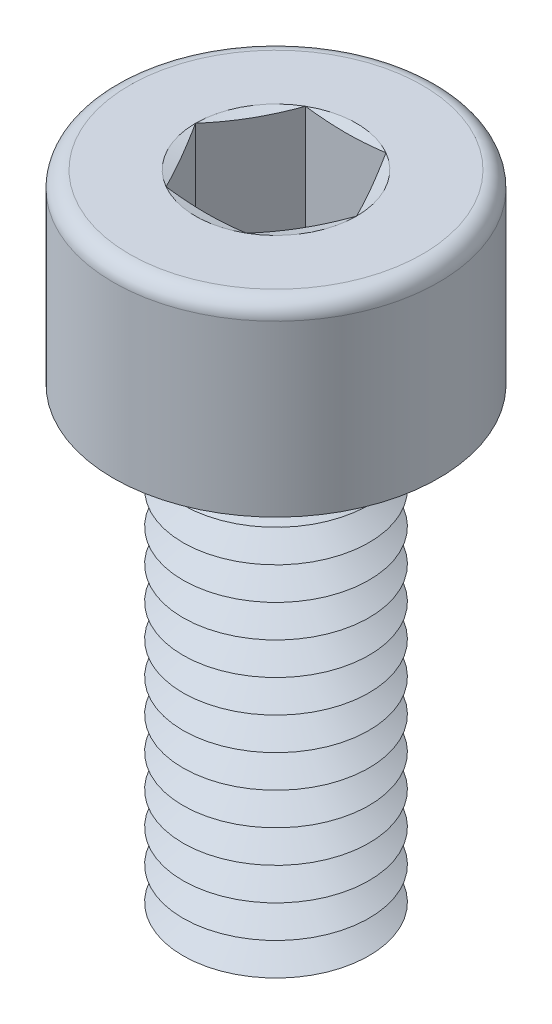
ISO-10303-21;
HEADER;
FILE_DESCRIPTION(('STEP AP214'),'2;1');
FILE_NAME('part.step','',(''),(''),'','','');
FILE_SCHEMA(('AUTOMOTIVE_DESIGN { 1 0 10303 214 1 1 1 1 }'));
ENDSEC;
DATA;
#1=APPLICATION_CONTEXT('core data for automotive mechanical design processes');
#2=APPLICATION_PROTOCOL_DEFINITION('international standard','automotive_design',2000,#1);
#3=PRODUCT_CONTEXT('',#1,'mechanical');
#4=PRODUCT('Part','Part','',(#3));
#5=PRODUCT_RELATED_PRODUCT_CATEGORY('part','',(#4));
#6=PRODUCT_DEFINITION_FORMATION('','',#4);
#7=PRODUCT_DEFINITION_CONTEXT('part definition',#1,'design');
#8=PRODUCT_DEFINITION('design','',#6,#7);
#9=PRODUCT_DEFINITION_SHAPE('','',#8);
#10=(LENGTH_UNIT() NAMED_UNIT(*) SI_UNIT(.MILLI.,.METRE.));
#11=(NAMED_UNIT(*) PLANE_ANGLE_UNIT() SI_UNIT($,.RADIAN.));
#12=(NAMED_UNIT(*) SI_UNIT($,.STERADIAN.) SOLID_ANGLE_UNIT());
#13=UNCERTAINTY_MEASURE_WITH_UNIT(LENGTH_MEASURE(1.E-05),#10,'distance_accuracy_value','');
#14=(GEOMETRIC_REPRESENTATION_CONTEXT(3) GLOBAL_UNCERTAINTY_ASSIGNED_CONTEXT((#13)) GLOBAL_UNIT_ASSIGNED_CONTEXT((#10,
#11,#12)) REPRESENTATION_CONTEXT('',''));
#15=CARTESIAN_POINT('',(0.,0.,0.));
#16=DIRECTION('',(0.,0.,1.));
#17=DIRECTION('',(1.,0.,0.));
#18=AXIS2_PLACEMENT_3D('',#15,#16,#17);
#19=CARTESIAN_POINT('',(0.,2.8,0.));
#20=DIRECTION('',(0.,1.,0.));
#21=DIRECTION('',(0.,0.,1.));
#22=AXIS2_PLACEMENT_3D('',#19,#20,#21);
#23=CONICAL_SURFACE('',#22,1.39378221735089,1.0471975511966);
#24=CARTESIAN_POINT('',(0.,3.15,0.));
#25=DIRECTION('',(0.,1.,0.));
#26=DIRECTION('',(0.,0.,1.));
#27=AXIS2_PLACEMENT_3D('',#24,#25,#26);
#28=CIRCLE('',#27,2.);
#29=CARTESIAN_POINT('',(0.,3.15,2.));
#30=VERTEX_POINT('',#29);
#31=EDGE_CURVE('E385',#30,#30,#28,.T.);
#32=ORIENTED_EDGE('',*,*,#31,.F.);
#33=EDGE_LOOP('',(#32));
#34=FACE_BOUND('',#33,.T.);
#35=CARTESIAN_POINT('',(0.,2.8,0.));
#36=DIRECTION('',(0.,1.,0.));
#37=DIRECTION('',(0.,0.,1.));
#38=AXIS2_PLACEMENT_3D('',#35,#36,#37);
#39=CIRCLE('',#38,1.39378221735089);
#40=CARTESIAN_POINT('',(0.,2.8,1.39378221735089));
#41=VERTEX_POINT('',#40);
#42=EDGE_CURVE('E388',#41,#41,#39,.T.);
#43=ORIENTED_EDGE('',*,*,#42,.T.);
#44=EDGE_LOOP('',(#43));
#45=FACE_BOUND('',#44,.T.);
#46=ADVANCED_FACE('F36',(#34,#45),#23,.T.);
#47=CARTESIAN_POINT('',(0.,2.45,0.));
#48=DIRECTION('',(0.,-1.,0.));
#49=DIRECTION('',(0.,0.,-1.));
#50=AXIS2_PLACEMENT_3D('',#47,#48,#49);
#51=CONICAL_SURFACE('',#50,2.,1.0471975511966);
#52=ORIENTED_EDGE('',*,*,#42,.F.);
#53=EDGE_LOOP('',(#52));
#54=FACE_BOUND('',#53,.T.);
#55=CARTESIAN_POINT('',(0.,2.45,0.));
#56=DIRECTION('',(0.,1.,0.));
#57=DIRECTION('',(0.,0.,1.));
#58=AXIS2_PLACEMENT_3D('',#55,#56,#57);
#59=CIRCLE('',#58,2.);
#60=CARTESIAN_POINT('',(0.,2.45,2.));
#61=VERTEX_POINT('',#60);
#62=EDGE_CURVE('E391',#61,#61,#59,.T.);
#63=ORIENTED_EDGE('',*,*,#62,.T.);
#64=EDGE_LOOP('',(#63));
#65=FACE_BOUND('',#64,.T.);
#66=ADVANCED_FACE('F236',(#54,#65),#51,.T.);
#67=CARTESIAN_POINT('',(0.,0.,0.));
#68=DIRECTION('',(0.,1.,0.));
#69=DIRECTION('',(0.,0.,1.));
#70=AXIS2_PLACEMENT_3D('',#67,#68,#69);
#71=PLANE('',#70);
#72=CARTESIAN_POINT('',(0.,0.,0.));
#73=DIRECTION('',(0.,1.,0.));
#74=DIRECTION('',(0.,0.,1.));
#75=AXIS2_PLACEMENT_3D('',#72,#73,#74);
#76=CIRCLE('',#75,1.39378221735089);
#77=CARTESIAN_POINT('',(0.,0.,1.39378221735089));
#78=VERTEX_POINT('',#77);
#79=EDGE_CURVE('E412',#78,#78,#76,.T.);
#80=ORIENTED_EDGE('',*,*,#79,.F.);
#81=EDGE_LOOP('',(#80));
#82=FACE_BOUND('',#81,.T.);
#83=ADVANCED_FACE('F233',(#82),#71,.F.);
#84=CARTESIAN_POINT('',(0.,0.,0.));
#85=DIRECTION('',(0.,1.,0.));
#86=DIRECTION('',(0.,0.,1.));
#87=AXIS2_PLACEMENT_3D('',#84,#85,#86);
#88=CONICAL_SURFACE('',#87,1.39378221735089,1.0471975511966);
#89=CARTESIAN_POINT('',(0.,0.35,0.));
#90=DIRECTION('',(0.,1.,0.));
#91=DIRECTION('',(0.,0.,1.));
#92=AXIS2_PLACEMENT_3D('',#89,#90,#91);
#93=CIRCLE('',#92,2.);
#94=CARTESIAN_POINT('',(0.,0.35,2.));
#95=VERTEX_POINT('',#94);
#96=EDGE_CURVE('E409',#95,#95,#93,.T.);
#97=ORIENTED_EDGE('',*,*,#96,.F.);
#98=EDGE_LOOP('',(#97));
#99=FACE_BOUND('',#98,.T.);
#100=ORIENTED_EDGE('',*,*,#79,.T.);
#101=EDGE_LOOP('',(#100));
#102=FACE_BOUND('',#101,.T.);
#103=ADVANCED_FACE('F235',(#99,#102),#88,.T.);
#104=CARTESIAN_POINT('',(0.,0.35,0.));
#105=DIRECTION('',(0.,-1.,0.));
#106=DIRECTION('',(0.,0.,-1.));
#107=AXIS2_PLACEMENT_3D('',#104,#105,#106);
#108=CONICAL_SURFACE('',#107,2.,1.0471975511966);
#109=CARTESIAN_POINT('',(0.,0.7,0.));
#110=DIRECTION('',(0.,1.,0.));
#111=DIRECTION('',(0.,0.,1.));
#112=AXIS2_PLACEMENT_3D('',#109,#110,#111);
#113=CIRCLE('',#112,1.39378221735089);
#114=CARTESIAN_POINT('',(0.,0.7,1.39378221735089));
#115=VERTEX_POINT('',#114);
#116=EDGE_CURVE('E406',#115,#115,#113,.T.);
#117=ORIENTED_EDGE('',*,*,#116,.F.);
#118=EDGE_LOOP('',(#117));
#119=FACE_BOUND('',#118,.T.);
#120=ORIENTED_EDGE('',*,*,#96,.T.);
#121=EDGE_LOOP('',(#120));
#122=FACE_BOUND('',#121,.T.);
#123=ADVANCED_FACE('F276',(#119,#122),#108,.T.);
#124=CARTESIAN_POINT('',(0.,0.7,0.));
#125=DIRECTION('',(0.,1.,0.));
#126=DIRECTION('',(0.,0.,1.));
#127=AXIS2_PLACEMENT_3D('',#124,#125,#126);
#128=CONICAL_SURFACE('',#127,1.39378221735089,1.0471975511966);
#129=CARTESIAN_POINT('',(0.,1.05,0.));
#130=DIRECTION('',(0.,1.,0.));
#131=DIRECTION('',(0.,0.,1.));
#132=AXIS2_PLACEMENT_3D('',#129,#130,#131);
#133=CIRCLE('',#132,2.);
#134=CARTESIAN_POINT('',(0.,1.05,2.));
#135=VERTEX_POINT('',#134);
#136=EDGE_CURVE('E403',#135,#135,#133,.T.);
#137=ORIENTED_EDGE('',*,*,#136,.F.);
#138=EDGE_LOOP('',(#137));
#139=FACE_BOUND('',#138,.T.);
#140=ORIENTED_EDGE('',*,*,#116,.T.);
#141=EDGE_LOOP('',(#140));
#142=FACE_BOUND('',#141,.T.);
#143=ADVANCED_FACE('F271',(#139,#142),#128,.T.);
#144=CARTESIAN_POINT('',(0.,1.05,0.));
#145=DIRECTION('',(0.,-1.,0.));
#146=DIRECTION('',(0.,0.,-1.));
#147=AXIS2_PLACEMENT_3D('',#144,#145,#146);
#148=CONICAL_SURFACE('',#147,2.,1.0471975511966);
#149=CARTESIAN_POINT('',(0.,1.4,0.));
#150=DIRECTION('',(0.,1.,0.));
#151=DIRECTION('',(0.,0.,1.));
#152=AXIS2_PLACEMENT_3D('',#149,#150,#151);
#153=CIRCLE('',#152,1.39378221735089);
#154=CARTESIAN_POINT('',(0.,1.4,1.39378221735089));
#155=VERTEX_POINT('',#154);
#156=EDGE_CURVE('E400',#155,#155,#153,.T.);
#157=ORIENTED_EDGE('',*,*,#156,.F.);
#158=EDGE_LOOP('',(#157));
#159=FACE_BOUND('',#158,.T.);
#160=ORIENTED_EDGE('',*,*,#136,.T.);
#161=EDGE_LOOP('',(#160));
#162=FACE_BOUND('',#161,.T.);
#163=ADVANCED_FACE('F268',(#159,#162),#148,.T.);
#164=CARTESIAN_POINT('',(0.,1.4,0.));
#165=DIRECTION('',(0.,1.,0.));
#166=DIRECTION('',(0.,0.,1.));
#167=AXIS2_PLACEMENT_3D('',#164,#165,#166);
#168=CONICAL_SURFACE('',#167,1.39378221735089,1.0471975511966);
#169=CARTESIAN_POINT('',(0.,1.75,0.));
#170=DIRECTION('',(0.,1.,0.));
#171=DIRECTION('',(0.,0.,1.));
#172=AXIS2_PLACEMENT_3D('',#169,#170,#171);
#173=CIRCLE('',#172,2.);
#174=CARTESIAN_POINT('',(0.,1.75,2.));
#175=VERTEX_POINT('',#174);
#176=EDGE_CURVE('E397',#175,#175,#173,.T.);
#177=ORIENTED_EDGE('',*,*,#176,.F.);
#178=EDGE_LOOP('',(#177));
#179=FACE_BOUND('',#178,.T.);
#180=ORIENTED_EDGE('',*,*,#156,.T.);
#181=EDGE_LOOP('',(#180));
#182=FACE_BOUND('',#181,.T.);
#183=ADVANCED_FACE('F262',(#179,#182),#168,.T.);
#184=CARTESIAN_POINT('',(0.,1.75,0.));
#185=DIRECTION('',(0.,-1.,0.));
#186=DIRECTION('',(0.,0.,-1.));
#187=AXIS2_PLACEMENT_3D('',#184,#185,#186);
#188=CONICAL_SURFACE('',#187,2.,1.0471975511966);
#189=CARTESIAN_POINT('',(0.,2.1,0.));
#190=DIRECTION('',(0.,1.,0.));
#191=DIRECTION('',(0.,0.,1.));
#192=AXIS2_PLACEMENT_3D('',#189,#190,#191);
#193=CIRCLE('',#192,1.39378221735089);
#194=CARTESIAN_POINT('',(0.,2.1,1.39378221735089));
#195=VERTEX_POINT('',#194);
#196=EDGE_CURVE('E394',#195,#195,#193,.T.);
#197=ORIENTED_EDGE('',*,*,#196,.F.);
#198=EDGE_LOOP('',(#197));
#199=FACE_BOUND('',#198,.T.);
#200=ORIENTED_EDGE('',*,*,#176,.T.);
#201=EDGE_LOOP('',(#200));
#202=FACE_BOUND('',#201,.T.);
#203=ADVANCED_FACE('F258',(#199,#202),#188,.T.);
#204=CARTESIAN_POINT('',(0.,2.1,0.));
#205=DIRECTION('',(0.,1.,0.));
#206=DIRECTION('',(0.,0.,1.));
#207=AXIS2_PLACEMENT_3D('',#204,#205,#206);
#208=CONICAL_SURFACE('',#207,1.39378221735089,1.0471975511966);
#209=ORIENTED_EDGE('',*,*,#62,.F.);
#210=EDGE_LOOP('',(#209));
#211=FACE_BOUND('',#210,.T.);
#212=ORIENTED_EDGE('',*,*,#196,.T.);
#213=EDGE_LOOP('',(#212));
#214=FACE_BOUND('',#213,.T.);
#215=ADVANCED_FACE('F261',(#211,#214),#208,.T.);
#216=CARTESIAN_POINT('',(0.,3.5,0.));
#217=DIRECTION('',(0.,1.,0.));
#218=DIRECTION('',(0.,0.,1.));
#219=AXIS2_PLACEMENT_3D('',#216,#217,#218);
#220=CONICAL_SURFACE('',#219,1.39378221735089,1.0471975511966);
#221=CARTESIAN_POINT('',(0.,3.85,0.));
#222=DIRECTION('',(0.,1.,0.));
#223=DIRECTION('',(0.,0.,1.));
#224=AXIS2_PLACEMENT_3D('',#221,#222,#223);
#225=CIRCLE('',#224,2.);
#226=CARTESIAN_POINT('',(0.,3.85,2.));
#227=VERTEX_POINT('',#226);
#228=EDGE_CURVE('E379',#227,#227,#225,.T.);
#229=ORIENTED_EDGE('',*,*,#228,.F.);
#230=EDGE_LOOP('',(#229));
#231=FACE_BOUND('',#230,.T.);
#232=CARTESIAN_POINT('',(0.,3.5,0.));
#233=DIRECTION('',(0.,1.,0.));
#234=DIRECTION('',(0.,0.,1.));
#235=AXIS2_PLACEMENT_3D('',#232,#233,#234);
#236=CIRCLE('',#235,1.39378221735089);
#237=CARTESIAN_POINT('',(0.,3.5,1.39378221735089));
#238=VERTEX_POINT('',#237);
#239=EDGE_CURVE('E382',#238,#238,#236,.T.);
#240=ORIENTED_EDGE('',*,*,#239,.T.);
#241=EDGE_LOOP('',(#240));
#242=FACE_BOUND('',#241,.T.);
#243=ADVANCED_FACE('F266',(#231,#242),#220,.T.);
#244=CARTESIAN_POINT('',(0.,3.15,0.));
#245=DIRECTION('',(0.,-1.,0.));
#246=DIRECTION('',(0.,0.,-1.));
#247=AXIS2_PLACEMENT_3D('',#244,#245,#246);
#248=CONICAL_SURFACE('',#247,2.,1.0471975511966);
#249=ORIENTED_EDGE('',*,*,#239,.F.);
#250=EDGE_LOOP('',(#249));
#251=FACE_BOUND('',#250,.T.);
#252=ORIENTED_EDGE('',*,*,#31,.T.);
#253=EDGE_LOOP('',(#252));
#254=FACE_BOUND('',#253,.T.);
#255=ADVANCED_FACE('F697',(#251,#254),#248,.T.);
#256=CARTESIAN_POINT('',(0.,4.2,0.));
#257=DIRECTION('',(0.,1.,0.));
#258=DIRECTION('',(0.,0.,1.));
#259=AXIS2_PLACEMENT_3D('',#256,#257,#258);
#260=CONICAL_SURFACE('',#259,1.39378221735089,1.0471975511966);
#261=CARTESIAN_POINT('',(0.,4.55,0.));
#262=DIRECTION('',(0.,1.,0.));
#263=DIRECTION('',(0.,0.,1.));
#264=AXIS2_PLACEMENT_3D('',#261,#262,#263);
#265=CIRCLE('',#264,2.);
#266=CARTESIAN_POINT('',(0.,4.55,2.));
#267=VERTEX_POINT('',#266);
#268=EDGE_CURVE('E373',#267,#267,#265,.T.);
#269=ORIENTED_EDGE('',*,*,#268,.F.);
#270=EDGE_LOOP('',(#269));
#271=FACE_BOUND('',#270,.T.);
#272=CARTESIAN_POINT('',(0.,4.2,0.));
#273=DIRECTION('',(0.,1.,0.));
#274=DIRECTION('',(0.,0.,1.));
#275=AXIS2_PLACEMENT_3D('',#272,#273,#274);
#276=CIRCLE('',#275,1.39378221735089);
#277=CARTESIAN_POINT('',(0.,4.2,1.39378221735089));
#278=VERTEX_POINT('',#277);
#279=EDGE_CURVE('E376',#278,#278,#276,.T.);
#280=ORIENTED_EDGE('',*,*,#279,.T.);
#281=EDGE_LOOP('',(#280));
#282=FACE_BOUND('',#281,.T.);
#283=ADVANCED_FACE('F687',(#271,#282),#260,.T.);
#284=CARTESIAN_POINT('',(0.,3.85,0.));
#285=DIRECTION('',(0.,-1.,0.));
#286=DIRECTION('',(0.,0.,-1.));
#287=AXIS2_PLACEMENT_3D('',#284,#285,#286);
#288=CONICAL_SURFACE('',#287,2.,1.0471975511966);
#289=ORIENTED_EDGE('',*,*,#279,.F.);
#290=EDGE_LOOP('',(#289));
#291=FACE_BOUND('',#290,.T.);
#292=ORIENTED_EDGE('',*,*,#228,.T.);
#293=EDGE_LOOP('',(#292));
#294=FACE_BOUND('',#293,.T.);
#295=ADVANCED_FACE('F677',(#291,#294),#288,.T.);
#296=CARTESIAN_POINT('',(0.,4.9,0.));
#297=DIRECTION('',(0.,1.,0.));
#298=DIRECTION('',(0.,0.,1.));
#299=AXIS2_PLACEMENT_3D('',#296,#297,#298);
#300=CONICAL_SURFACE('',#299,1.39378221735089,1.0471975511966);
#301=CARTESIAN_POINT('',(0.,5.25,0.));
#302=DIRECTION('',(0.,1.,0.));
#303=DIRECTION('',(0.,0.,1.));
#304=AXIS2_PLACEMENT_3D('',#301,#302,#303);
#305=CIRCLE('',#304,2.);
#306=CARTESIAN_POINT('',(0.,5.25,2.));
#307=VERTEX_POINT('',#306);
#308=EDGE_CURVE('E367',#307,#307,#305,.T.);
#309=ORIENTED_EDGE('',*,*,#308,.F.);
#310=EDGE_LOOP('',(#309));
#311=FACE_BOUND('',#310,.T.);
#312=CARTESIAN_POINT('',(0.,4.9,0.));
#313=DIRECTION('',(0.,1.,0.));
#314=DIRECTION('',(0.,0.,1.));
#315=AXIS2_PLACEMENT_3D('',#312,#313,#314);
#316=CIRCLE('',#315,1.39378221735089);
#317=CARTESIAN_POINT('',(0.,4.9,1.39378221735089));
#318=VERTEX_POINT('',#317);
#319=EDGE_CURVE('E370',#318,#318,#316,.T.);
#320=ORIENTED_EDGE('',*,*,#319,.T.);
#321=EDGE_LOOP('',(#320));
#322=FACE_BOUND('',#321,.T.);
#323=ADVANCED_FACE('F667',(#311,#322),#300,.T.);
#324=CARTESIAN_POINT('',(0.,4.55,0.));
#325=DIRECTION('',(0.,-1.,0.));
#326=DIRECTION('',(0.,0.,-1.));
#327=AXIS2_PLACEMENT_3D('',#324,#325,#326);
#328=CONICAL_SURFACE('',#327,2.,1.0471975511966);
#329=ORIENTED_EDGE('',*,*,#319,.F.);
#330=EDGE_LOOP('',(#329));
#331=FACE_BOUND('',#330,.T.);
#332=ORIENTED_EDGE('',*,*,#268,.T.);
#333=EDGE_LOOP('',(#332));
#334=FACE_BOUND('',#333,.T.);
#335=ADVANCED_FACE('F657',(#331,#334),#328,.T.);
#336=CARTESIAN_POINT('',(0.,5.6,0.));
#337=DIRECTION('',(0.,1.,0.));
#338=DIRECTION('',(0.,0.,1.));
#339=AXIS2_PLACEMENT_3D('',#336,#337,#338);
#340=CONICAL_SURFACE('',#339,1.39378221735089,1.0471975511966);
#341=CARTESIAN_POINT('',(0.,5.95,0.));
#342=DIRECTION('',(0.,1.,0.));
#343=DIRECTION('',(0.,0.,1.));
#344=AXIS2_PLACEMENT_3D('',#341,#342,#343);
#345=CIRCLE('',#344,2.);
#346=CARTESIAN_POINT('',(0.,5.95,2.));
#347=VERTEX_POINT('',#346);
#348=EDGE_CURVE('E361',#347,#347,#345,.T.);
#349=ORIENTED_EDGE('',*,*,#348,.F.);
#350=EDGE_LOOP('',(#349));
#351=FACE_BOUND('',#350,.T.);
#352=CARTESIAN_POINT('',(0.,5.6,0.));
#353=DIRECTION('',(0.,1.,0.));
#354=DIRECTION('',(0.,0.,1.));
#355=AXIS2_PLACEMENT_3D('',#352,#353,#354);
#356=CIRCLE('',#355,1.39378221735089);
#357=CARTESIAN_POINT('',(0.,5.6,1.39378221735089));
#358=VERTEX_POINT('',#357);
#359=EDGE_CURVE('E364',#358,#358,#356,.T.);
#360=ORIENTED_EDGE('',*,*,#359,.T.);
#361=EDGE_LOOP('',(#360));
#362=FACE_BOUND('',#361,.T.);
#363=ADVANCED_FACE('F647',(#351,#362),#340,.T.);
#364=CARTESIAN_POINT('',(0.,5.25,0.));
#365=DIRECTION('',(0.,-1.,0.));
#366=DIRECTION('',(0.,0.,-1.));
#367=AXIS2_PLACEMENT_3D('',#364,#365,#366);
#368=CONICAL_SURFACE('',#367,2.,1.0471975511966);
#369=ORIENTED_EDGE('',*,*,#359,.F.);
#370=EDGE_LOOP('',(#369));
#371=FACE_BOUND('',#370,.T.);
#372=ORIENTED_EDGE('',*,*,#308,.T.);
#373=EDGE_LOOP('',(#372));
#374=FACE_BOUND('',#373,.T.);
#375=ADVANCED_FACE('F637',(#371,#374),#368,.T.);
#376=CARTESIAN_POINT('',(0.,6.3,0.));
#377=DIRECTION('',(0.,1.,0.));
#378=DIRECTION('',(0.,0.,1.));
#379=AXIS2_PLACEMENT_3D('',#376,#377,#378);
#380=CONICAL_SURFACE('',#379,1.39378221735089,1.0471975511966);
#381=CARTESIAN_POINT('',(0.,6.65,0.));
#382=DIRECTION('',(0.,1.,0.));
#383=DIRECTION('',(0.,0.,1.));
#384=AXIS2_PLACEMENT_3D('',#381,#382,#383);
#385=CIRCLE('',#384,2.);
#386=CARTESIAN_POINT('',(0.,6.65,2.));
#387=VERTEX_POINT('',#386);
#388=EDGE_CURVE('E355',#387,#387,#385,.T.);
#389=ORIENTED_EDGE('',*,*,#388,.F.);
#390=EDGE_LOOP('',(#389));
#391=FACE_BOUND('',#390,.T.);
#392=CARTESIAN_POINT('',(0.,6.3,0.));
#393=DIRECTION('',(0.,1.,0.));
#394=DIRECTION('',(0.,0.,1.));
#395=AXIS2_PLACEMENT_3D('',#392,#393,#394);
#396=CIRCLE('',#395,1.39378221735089);
#397=CARTESIAN_POINT('',(0.,6.3,1.39378221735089));
#398=VERTEX_POINT('',#397);
#399=EDGE_CURVE('E358',#398,#398,#396,.T.);
#400=ORIENTED_EDGE('',*,*,#399,.T.);
#401=EDGE_LOOP('',(#400));
#402=FACE_BOUND('',#401,.T.);
#403=ADVANCED_FACE('F627',(#391,#402),#380,.T.);
#404=CARTESIAN_POINT('',(0.,5.95,0.));
#405=DIRECTION('',(0.,-1.,0.));
#406=DIRECTION('',(0.,0.,-1.));
#407=AXIS2_PLACEMENT_3D('',#404,#405,#406);
#408=CONICAL_SURFACE('',#407,2.,1.0471975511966);
#409=ORIENTED_EDGE('',*,*,#399,.F.);
#410=EDGE_LOOP('',(#409));
#411=FACE_BOUND('',#410,.T.);
#412=ORIENTED_EDGE('',*,*,#348,.T.);
#413=EDGE_LOOP('',(#412));
#414=FACE_BOUND('',#413,.T.);
#415=ADVANCED_FACE('F617',(#411,#414),#408,.T.);
#416=CARTESIAN_POINT('',(0.,7.,0.));
#417=DIRECTION('',(0.,1.,0.));
#418=DIRECTION('',(0.,0.,1.));
#419=AXIS2_PLACEMENT_3D('',#416,#417,#418);
#420=CONICAL_SURFACE('',#419,1.39378221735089,1.0471975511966);
#421=CARTESIAN_POINT('',(0.,7.35,0.));
#422=DIRECTION('',(0.,1.,0.));
#423=DIRECTION('',(0.,0.,1.));
#424=AXIS2_PLACEMENT_3D('',#421,#422,#423);
#425=CIRCLE('',#424,2.);
#426=CARTESIAN_POINT('',(0.,7.35,2.));
#427=VERTEX_POINT('',#426);
#428=EDGE_CURVE('E349',#427,#427,#425,.T.);
#429=ORIENTED_EDGE('',*,*,#428,.F.);
#430=EDGE_LOOP('',(#429));
#431=FACE_BOUND('',#430,.T.);
#432=CARTESIAN_POINT('',(0.,7.,0.));
#433=DIRECTION('',(0.,1.,0.));
#434=DIRECTION('',(0.,0.,1.));
#435=AXIS2_PLACEMENT_3D('',#432,#433,#434);
#436=CIRCLE('',#435,1.39378221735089);
#437=CARTESIAN_POINT('',(0.,7.,1.39378221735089));
#438=VERTEX_POINT('',#437);
#439=EDGE_CURVE('E352',#438,#438,#436,.T.);
#440=ORIENTED_EDGE('',*,*,#439,.T.);
#441=EDGE_LOOP('',(#440));
#442=FACE_BOUND('',#441,.T.);
#443=ADVANCED_FACE('F607',(#431,#442),#420,.T.);
#444=CARTESIAN_POINT('',(0.,6.65,0.));
#445=DIRECTION('',(0.,-1.,0.));
#446=DIRECTION('',(0.,0.,-1.));
#447=AXIS2_PLACEMENT_3D('',#444,#445,#446);
#448=CONICAL_SURFACE('',#447,2.,1.0471975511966);
#449=ORIENTED_EDGE('',*,*,#439,.F.);
#450=EDGE_LOOP('',(#449));
#451=FACE_BOUND('',#450,.T.);
#452=ORIENTED_EDGE('',*,*,#388,.T.);
#453=EDGE_LOOP('',(#452));
#454=FACE_BOUND('',#453,.T.);
#455=ADVANCED_FACE('F597',(#451,#454),#448,.T.);
#456=CARTESIAN_POINT('',(0.,7.7,0.));
#457=DIRECTION('',(0.,1.,0.));
#458=DIRECTION('',(0.,0.,1.));
#459=AXIS2_PLACEMENT_3D('',#456,#457,#458);
#460=CONICAL_SURFACE('',#459,1.39378221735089,1.0471975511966);
#461=CARTESIAN_POINT('',(0.,8.05,0.));
#462=DIRECTION('',(0.,1.,0.));
#463=DIRECTION('',(0.,0.,1.));
#464=AXIS2_PLACEMENT_3D('',#461,#462,#463);
#465=CIRCLE('',#464,2.);
#466=CARTESIAN_POINT('',(0.,8.05,2.));
#467=VERTEX_POINT('',#466);
#468=EDGE_CURVE('E343',#467,#467,#465,.T.);
#469=ORIENTED_EDGE('',*,*,#468,.F.);
#470=EDGE_LOOP('',(#469));
#471=FACE_BOUND('',#470,.T.);
#472=CARTESIAN_POINT('',(0.,7.7,0.));
#473=DIRECTION('',(0.,1.,0.));
#474=DIRECTION('',(0.,0.,1.));
#475=AXIS2_PLACEMENT_3D('',#472,#473,#474);
#476=CIRCLE('',#475,1.39378221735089);
#477=CARTESIAN_POINT('',(0.,7.7,1.39378221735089));
#478=VERTEX_POINT('',#477);
#479=EDGE_CURVE('E346',#478,#478,#476,.T.);
#480=ORIENTED_EDGE('',*,*,#479,.T.);
#481=EDGE_LOOP('',(#480));
#482=FACE_BOUND('',#481,.T.);
#483=ADVANCED_FACE('F587',(#471,#482),#460,.T.);
#484=CARTESIAN_POINT('',(0.,7.35,0.));
#485=DIRECTION('',(0.,-1.,0.));
#486=DIRECTION('',(0.,0.,-1.));
#487=AXIS2_PLACEMENT_3D('',#484,#485,#486);
#488=CONICAL_SURFACE('',#487,2.,1.0471975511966);
#489=ORIENTED_EDGE('',*,*,#479,.F.);
#490=EDGE_LOOP('',(#489));
#491=FACE_BOUND('',#490,.T.);
#492=ORIENTED_EDGE('',*,*,#428,.T.);
#493=EDGE_LOOP('',(#492));
#494=FACE_BOUND('',#493,.T.);
#495=ADVANCED_FACE('F577',(#491,#494),#488,.T.);
#496=CARTESIAN_POINT('',(0.,8.4,0.));
#497=DIRECTION('',(0.,1.,0.));
#498=DIRECTION('',(0.,0.,1.));
#499=AXIS2_PLACEMENT_3D('',#496,#497,#498);
#500=CONICAL_SURFACE('',#499,1.39378221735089,1.0471975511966);
#501=CARTESIAN_POINT('',(0.,8.75,0.));
#502=DIRECTION('',(0.,1.,0.));
#503=DIRECTION('',(0.,0.,1.));
#504=AXIS2_PLACEMENT_3D('',#501,#502,#503);
#505=CIRCLE('',#504,2.);
#506=CARTESIAN_POINT('',(0.,8.75,2.));
#507=VERTEX_POINT('',#506);
#508=EDGE_CURVE('E332',#507,#507,#505,.T.);
#509=ORIENTED_EDGE('',*,*,#508,.F.);
#510=EDGE_LOOP('',(#509));
#511=FACE_BOUND('',#510,.T.);
#512=CARTESIAN_POINT('',(0.,8.4,0.));
#513=DIRECTION('',(0.,1.,0.));
#514=DIRECTION('',(0.,0.,1.));
#515=AXIS2_PLACEMENT_3D('',#512,#513,#514);
#516=CIRCLE('',#515,1.39378221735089);
#517=CARTESIAN_POINT('',(0.,8.4,1.39378221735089));
#518=VERTEX_POINT('',#517);
#519=EDGE_CURVE('E340',#518,#518,#516,.T.);
#520=ORIENTED_EDGE('',*,*,#519,.T.);
#521=EDGE_LOOP('',(#520));
#522=FACE_BOUND('',#521,.T.);
#523=ADVANCED_FACE('F567',(#511,#522),#500,.T.);
#524=CARTESIAN_POINT('',(0.,8.05,0.));
#525=DIRECTION('',(0.,-1.,0.));
#526=DIRECTION('',(0.,0.,-1.));
#527=AXIS2_PLACEMENT_3D('',#524,#525,#526);
#528=CONICAL_SURFACE('',#527,2.,1.0471975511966);
#529=ORIENTED_EDGE('',*,*,#519,.F.);
#530=EDGE_LOOP('',(#529));
#531=FACE_BOUND('',#530,.T.);
#532=ORIENTED_EDGE('',*,*,#468,.T.);
#533=EDGE_LOOP('',(#532));
#534=FACE_BOUND('',#533,.T.);
#535=ADVANCED_FACE('F558',(#531,#534),#528,.T.);
#536=CARTESIAN_POINT('',(0.,9.1,0.));
#537=DIRECTION('',(0.,1.,0.));
#538=DIRECTION('',(0.,0.,1.));
#539=AXIS2_PLACEMENT_3D('',#536,#537,#538);
#540=CONICAL_SURFACE('',#539,1.39378221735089,1.0471975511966);
#541=CARTESIAN_POINT('',(0.,9.45,0.));
#542=DIRECTION('',(0.,1.,0.));
#543=DIRECTION('',(0.,0.,1.));
#544=AXIS2_PLACEMENT_3D('',#541,#542,#543);
#545=CIRCLE('',#544,2.);
#546=CARTESIAN_POINT('',(0.,9.45,2.));
#547=VERTEX_POINT('',#546);
#548=EDGE_CURVE('E336',#547,#547,#545,.T.);
#549=ORIENTED_EDGE('',*,*,#548,.F.);
#550=EDGE_LOOP('',(#549));
#551=FACE_BOUND('',#550,.T.);
#552=CARTESIAN_POINT('',(0.,9.1,0.));
#553=DIRECTION('',(0.,1.,0.));
#554=DIRECTION('',(0.,0.,1.));
#555=AXIS2_PLACEMENT_3D('',#552,#553,#554);
#556=CIRCLE('',#555,1.39378221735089);
#557=CARTESIAN_POINT('',(0.,9.1,1.39378221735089));
#558=VERTEX_POINT('',#557);
#559=EDGE_CURVE('E330',#558,#558,#556,.T.);
#560=ORIENTED_EDGE('',*,*,#559,.T.);
#561=EDGE_LOOP('',(#560));
#562=FACE_BOUND('',#561,.T.);
#563=ADVANCED_FACE('F549',(#551,#562),#540,.T.);
#564=CARTESIAN_POINT('',(0.,8.75,0.));
#565=DIRECTION('',(0.,-1.,0.));
#566=DIRECTION('',(0.,0.,-1.));
#567=AXIS2_PLACEMENT_3D('',#564,#565,#566);
#568=CONICAL_SURFACE('',#567,2.,1.0471975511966);
#569=ORIENTED_EDGE('',*,*,#559,.F.);
#570=EDGE_LOOP('',(#569));
#571=FACE_BOUND('',#570,.T.);
#572=ORIENTED_EDGE('',*,*,#508,.T.);
#573=EDGE_LOOP('',(#572));
#574=FACE_BOUND('',#573,.T.);
#575=ADVANCED_FACE('F181',(#571,#574),#568,.T.);
#576=CARTESIAN_POINT('',(0.,14.,0.));
#577=DIRECTION('',(0.,1.,0.));
#578=DIRECTION('',(0.,0.,1.));
#579=AXIS2_PLACEMENT_3D('',#576,#577,#578);
#580=PLANE('',#579);
#581=CARTESIAN_POINT('',(0.,14.,0.));
#582=DIRECTION('',(0.,1.,0.));
#583=DIRECTION('',(0.,0.,1.));
#584=AXIS2_PLACEMENT_3D('',#581,#582,#583);
#585=CIRCLE('',#584,1.73205080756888);
#586=CARTESIAN_POINT('',(0.866025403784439,14.,1.5));
#587=VERTEX_POINT('',#586);
#588=CARTESIAN_POINT('',(1.73205080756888,14.,0.));
#589=VERTEX_POINT('',#588);
#590=EDGE_CURVE('E115',#587,#589,#585,.T.);
#591=ORIENTED_EDGE('',*,*,#590,.F.);
#592=CARTESIAN_POINT('',(0.,14.,0.));
#593=DIRECTION('',(0.,1.,0.));
#594=DIRECTION('',(0.,0.,1.));
#595=AXIS2_PLACEMENT_3D('',#592,#593,#594);
#596=CIRCLE('',#595,1.73205080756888);
#597=CARTESIAN_POINT('',(-0.866025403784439,14.,1.5));
#598=VERTEX_POINT('',#597);
#599=EDGE_CURVE('E40',#598,#587,#596,.T.);
#600=ORIENTED_EDGE('',*,*,#599,.F.);
#601=CARTESIAN_POINT('',(-1.73205080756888,14.,0.));
#602=VERTEX_POINT('',#601);
#603=EDGE_CURVE('E130',#602,#598,#596,.T.);
#604=ORIENTED_EDGE('',*,*,#603,.F.);
#605=CARTESIAN_POINT('',(-0.866025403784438,14.,-1.5));
#606=VERTEX_POINT('',#605);
#607=EDGE_CURVE('E893',#606,#602,#596,.T.);
#608=ORIENTED_EDGE('',*,*,#607,.F.);
#609=CARTESIAN_POINT('',(0.866025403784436,14.,-1.5));
#610=VERTEX_POINT('',#609);
#611=EDGE_CURVE('E45',#610,#606,#596,.T.);
#612=ORIENTED_EDGE('',*,*,#611,.F.);
#613=EDGE_CURVE('E11',#589,#610,#596,.T.);
#614=ORIENTED_EDGE('',*,*,#613,.F.);
#615=EDGE_LOOP('',(#591,#600,#604,#608,#612,#614));
#616=FACE_BOUND('',#615,.T.);
#617=CARTESIAN_POINT('',(0.,14.,0.));
#618=DIRECTION('',(0.,1.,0.));
#619=DIRECTION('',(0.,0.,1.));
#620=AXIS2_PLACEMENT_3D('',#617,#618,#619);
#621=CIRCLE('',#620,3.15);
#622=CARTESIAN_POINT('',(0.,14.,3.15));
#623=VERTEX_POINT('',#622);
#624=EDGE_CURVE('E444',#623,#623,#621,.T.);
#625=ORIENTED_EDGE('',*,*,#624,.T.);
#626=EDGE_LOOP('',(#625));
#627=FACE_BOUND('',#626,.T.);
#628=ADVANCED_FACE('F132',(#616,#627),#580,.T.);
#629=CARTESIAN_POINT('',(0.,13.65,0.));
#630=DIRECTION('',(0.,1.,0.));
#631=DIRECTION('',(0.,0.,1.));
#632=AXIS2_PLACEMENT_3D('',#629,#630,#631);
#633=TOROIDAL_SURFACE('',#632,3.15,0.35);
#634=CARTESIAN_POINT('',(0.,13.65,0.));
#635=DIRECTION('',(0.,1.,0.));
#636=DIRECTION('',(0.,0.,1.));
#637=AXIS2_PLACEMENT_3D('',#634,#635,#636);
#638=CIRCLE('',#637,3.5);
#639=CARTESIAN_POINT('',(0.,13.65,3.5));
#640=VERTEX_POINT('',#639);
#641=EDGE_CURVE('E447',#640,#640,#638,.F.);
#642=ORIENTED_EDGE('',*,*,#641,.F.);
#643=EDGE_LOOP('',(#642));
#644=FACE_BOUND('',#643,.T.);
#645=ORIENTED_EDGE('',*,*,#624,.F.);
#646=EDGE_LOOP('',(#645));
#647=FACE_BOUND('',#646,.T.);
#648=ADVANCED_FACE('F38',(#644,#647),#633,.T.);
#649=CARTESIAN_POINT('',(0.,14.,0.));
#650=DIRECTION('',(0.,-1.,0.));
#651=DIRECTION('',(0.,0.,-1.));
#652=AXIS2_PLACEMENT_3D('',#649,#650,#651);
#653=CYLINDRICAL_SURFACE('',#652,3.5);
#654=ORIENTED_EDGE('',*,*,#641,.T.);
#655=EDGE_LOOP('',(#654));
#656=FACE_BOUND('',#655,.T.);
#657=CARTESIAN_POINT('',(0.,10.,0.));
#658=DIRECTION('',(0.,1.,0.));
#659=DIRECTION('',(0.,0.,1.));
#660=AXIS2_PLACEMENT_3D('',#657,#658,#659);
#661=CIRCLE('',#660,3.5);
#662=CARTESIAN_POINT('',(0.,10.,3.5));
#663=VERTEX_POINT('',#662);
#664=EDGE_CURVE('E435',#663,#663,#661,.T.);
#665=ORIENTED_EDGE('',*,*,#664,.T.);
#666=EDGE_LOOP('',(#665));
#667=FACE_BOUND('',#666,.T.);
#668=ADVANCED_FACE('F228',(#656,#667),#653,.T.);
#669=CARTESIAN_POINT('',(0.,10.,0.));
#670=DIRECTION('',(0.,1.,0.));
#671=DIRECTION('',(0.,0.,1.));
#672=AXIS2_PLACEMENT_3D('',#669,#670,#671);
#673=PLANE('',#672);
#674=ORIENTED_EDGE('',*,*,#664,.F.);
#675=EDGE_LOOP('',(#674));
#676=FACE_BOUND('',#675,.T.);
#677=CARTESIAN_POINT('',(0.,10.,0.));
#678=DIRECTION('',(0.,1.,0.));
#679=DIRECTION('',(0.,0.,1.));
#680=AXIS2_PLACEMENT_3D('',#677,#678,#679);
#681=CIRCLE('',#680,2.);
#682=CARTESIAN_POINT('',(0.,10.,2.));
#683=VERTEX_POINT('',#682);
#684=EDGE_CURVE('E441',#683,#683,#681,.T.);
#685=ORIENTED_EDGE('',*,*,#684,.T.);
#686=EDGE_LOOP('',(#685));
#687=FACE_BOUND('',#686,.T.);
#688=ADVANCED_FACE('F224',(#676,#687),#673,.F.);
#689=CARTESIAN_POINT('',(0.,10.,0.));
#690=DIRECTION('',(0.,-1.,0.));
#691=DIRECTION('',(0.,0.,-1.));
#692=AXIS2_PLACEMENT_3D('',#689,#690,#691);
#693=CYLINDRICAL_SURFACE('',#692,2.);
#694=ORIENTED_EDGE('',*,*,#548,.T.);
#695=EDGE_LOOP('',(#694));
#696=FACE_BOUND('',#695,.T.);
#697=ORIENTED_EDGE('',*,*,#684,.F.);
#698=EDGE_LOOP('',(#697));
#699=FACE_BOUND('',#698,.T.);
#700=ADVANCED_FACE('F227',(#696,#699),#693,.T.);
#701=CARTESIAN_POINT('',(0.,14.,0.));
#702=DIRECTION('',(0.,1.,0.));
#703=DIRECTION('',(0.,0.,1.));
#704=AXIS2_PLACEMENT_3D('',#701,#702,#703);
#705=CONICAL_SURFACE('',#704,1.73205080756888,1.30899693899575);
#706=ORIENTED_EDGE('',*,*,#599,.T.);
#707=CARTESIAN_POINT('',(-2.26080568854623,14.2628876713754,1.5));
#708=CARTESIAN_POINT('',(-2.19307335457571,14.247767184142,1.5));
#709=CARTESIAN_POINT('',(-2.12529797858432,14.2328393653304,1.5));
#710=CARTESIAN_POINT('',(-1.98963961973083,14.203466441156,1.5));
#711=CARTESIAN_POINT('',(-1.92175663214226,14.1890213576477,1.5));
#712=CARTESIAN_POINT('',(-1.71778516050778,14.146529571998,1.5));
#713=CARTESIAN_POINT('',(-1.58151166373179,14.1193574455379,1.5));
#714=CARTESIAN_POINT('',(-1.30947840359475,14.0687885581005,1.5));
#715=CARTESIAN_POINT('',(-1.17372447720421,14.0453610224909,1.5));
#716=CARTESIAN_POINT('',(-0.901404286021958,14.0038503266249,1.5));
#717=CARTESIAN_POINT('',(-0.764838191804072,13.9857660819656,1.5));
#718=CARTESIAN_POINT('',(-0.48929318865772,13.9572920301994,1.5));
#719=CARTESIAN_POINT('',(-0.350304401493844,13.9469908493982,1.5));
#720=CARTESIAN_POINT('',(-0.141571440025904,13.9391816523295,1.5));
#721=CARTESIAN_POINT('',(-0.0719628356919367,13.937851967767,1.5));
#722=CARTESIAN_POINT('',(0.0672555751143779,13.9377933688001,1.5));
#723=CARTESIAN_POINT('',(0.136865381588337,13.9390644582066,1.5));
#724=CARTESIAN_POINT('',(0.346114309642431,13.9467225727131,1.5));
#725=CARTESIAN_POINT('',(0.485619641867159,13.9569747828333,1.5));
#726=CARTESIAN_POINT('',(0.763829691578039,13.9856001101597,1.5));
#727=CARTESIAN_POINT('',(0.902533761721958,14.0039790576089,1.5));
#728=CARTESIAN_POINT('',(1.18270277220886,14.0467752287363,1.5));
#729=CARTESIAN_POINT('',(1.32414472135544,14.0713381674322,1.5));
#730=CARTESIAN_POINT('',(1.60634089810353,14.1241771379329,1.5));
#731=CARTESIAN_POINT('',(1.7470950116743,14.1524537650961,1.5));
#732=CARTESIAN_POINT('',(2.02813528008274,14.2114128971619,1.5));
#733=CARTESIAN_POINT('',(2.16842128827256,14.2420960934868,1.5));
#734=CARTESIAN_POINT('',(2.4486355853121,14.3050575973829,1.5));
#735=CARTESIAN_POINT('',(2.58856386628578,14.3373359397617,1.5));
#736=CARTESIAN_POINT('',(2.86645602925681,14.4025869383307,1.5));
#737=CARTESIAN_POINT('',(3.00442304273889,14.435546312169,1.5));
#738=CARTESIAN_POINT('',(3.28017563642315,14.5022271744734,1.5));
#739=CARTESIAN_POINT('',(3.41796121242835,14.5359486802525,1.5));
#740=CARTESIAN_POINT('',(3.69320305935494,14.6038996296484,1.5));
#741=CARTESIAN_POINT('',(3.83065952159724,14.6381282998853,1.5));
#742=CARTESIAN_POINT('',(4.10546119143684,14.7070087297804,1.5));
#743=CARTESIAN_POINT('',(4.24280640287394,14.7416604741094,1.5));
#744=CARTESIAN_POINT('',(4.38011382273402,14.7764596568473,1.5));
#745=B_SPLINE_CURVE_WITH_KNOTS('',3,(#707,#708,#709,#710,#711,#712,#713,#714,#715,#716,#717,
#718,#719,#720,#721,#722,#723,#724,#725,#726,#727,#728,#729,#730,#731,#732,#733,#734,#735,#736,
#737,#738,#739,#740,#741,#742,#743,#744),.UNSPECIFIED.,.F.,.F.,(4,2,2,2,2,2,2,2,2,2,2,2,2,2,2,2,
2,2,4),(0.,0.208198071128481,0.416405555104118,0.833243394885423,1.24645656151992,
1.65958581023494,2.07735129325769,2.28617008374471,2.49498918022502,2.91428402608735,
3.33388016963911,3.76448033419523,4.19514961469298,4.62594308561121,5.05674596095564,
5.48229088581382,5.90784548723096,6.33280701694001,6.75775319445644),.UNSPECIFIED.);
#746=EDGE_CURVE('E120',#598,#587,#745,.T.);
#747=ORIENTED_EDGE('',*,*,#746,.F.);
#748=EDGE_LOOP('',(#706,#747));
#749=FACE_BOUND('',#748,.T.);
#750=ADVANCED_FACE('F125',(#749),#705,.F.);
#751=ORIENTED_EDGE('',*,*,#603,.T.);
#752=CARTESIAN_POINT('',(-1.73216627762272,14.0000309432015,-0.000200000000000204));
#753=CARTESIAN_POINT('',(-1.69619286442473,13.9903863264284,0.0621077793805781));
#754=CARTESIAN_POINT('',(-1.66015421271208,13.9816304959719,0.124528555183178));
#755=CARTESIAN_POINT('',(-1.58794959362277,13.9662471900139,0.249590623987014));
#756=CARTESIAN_POINT('',(-1.55178358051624,13.9596205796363,0.312231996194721));
#757=CARTESIAN_POINT('',(-1.47954358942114,13.948882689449,0.437355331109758));
#758=CARTESIAN_POINT('',(-1.44347010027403,13.9447586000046,0.499836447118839));
#759=CARTESIAN_POINT('',(-1.37127710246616,13.9392286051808,0.624878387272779));
#760=CARTESIAN_POINT('',(-1.33515760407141,13.9378221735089,0.687439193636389));
#761=CARTESIAN_POINT('',(-1.26291860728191,13.9378221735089,0.81256080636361));
#762=CARTESIAN_POINT('',(-1.22679910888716,13.9392286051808,0.87512161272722));
#763=CARTESIAN_POINT('',(-1.15460611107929,13.9447586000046,1.00016355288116));
#764=CARTESIAN_POINT('',(-1.11853262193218,13.948882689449,1.06264466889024));
#765=CARTESIAN_POINT('',(-1.04629263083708,13.9596205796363,1.18776800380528));
#766=CARTESIAN_POINT('',(-1.01012661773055,13.9662471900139,1.25040937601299));
#767=CARTESIAN_POINT('',(-0.937921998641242,13.9816304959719,1.37547144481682));
#768=CARTESIAN_POINT('',(-0.901883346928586,13.9903863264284,1.43789222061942));
#769=CARTESIAN_POINT('',(-0.865909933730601,14.0000309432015,1.5002));
#770=B_SPLINE_CURVE_WITH_KNOTS('',3,(#752,#753,#754,#755,#756,#757,#758,#759,#760,#761,#762,
#763,#764,#765,#766,#767,#768,#769),.UNSPECIFIED.,.F.,.F.,(4,2,2,2,2,2,2,2,4),(0.,
0.217782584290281,0.435653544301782,0.652399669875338,0.869103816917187,1.08580796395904,
1.30255408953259,1.52042504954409,1.73820763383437),.UNSPECIFIED.);
#771=EDGE_CURVE('E152',#602,#598,#770,.T.);
#772=ORIENTED_EDGE('',*,*,#771,.F.);
#773=EDGE_LOOP('',(#751,#772));
#774=FACE_BOUND('',#773,.T.);
#775=ADVANCED_FACE('F243',(#774),#705,.F.);
#776=ORIENTED_EDGE('',*,*,#607,.T.);
#777=CARTESIAN_POINT('',(-0.865909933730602,14.0000309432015,-1.5002));
#778=CARTESIAN_POINT('',(-0.901883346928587,13.9903863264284,-1.43789222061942));
#779=CARTESIAN_POINT('',(-0.937921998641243,13.9816304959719,-1.37547144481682));
#780=CARTESIAN_POINT('',(-1.01012661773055,13.9662471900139,-1.25040937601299));
#781=CARTESIAN_POINT('',(-1.04629263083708,13.9596205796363,-1.18776800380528));
#782=CARTESIAN_POINT('',(-1.11853262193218,13.948882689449,-1.06264466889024));
#783=CARTESIAN_POINT('',(-1.15460611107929,13.9447586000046,-1.00016355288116));
#784=CARTESIAN_POINT('',(-1.22679910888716,13.9392286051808,-0.875121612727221));
#785=CARTESIAN_POINT('',(-1.26291860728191,13.9378221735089,-0.81256080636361));
#786=CARTESIAN_POINT('',(-1.33515760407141,13.9378221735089,-0.687439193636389));
#787=CARTESIAN_POINT('',(-1.37127710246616,13.9392286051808,-0.624878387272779));
#788=CARTESIAN_POINT('',(-1.44347010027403,13.9447586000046,-0.499836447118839));
#789=CARTESIAN_POINT('',(-1.47954358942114,13.948882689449,-0.437355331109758));
#790=CARTESIAN_POINT('',(-1.55178358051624,13.9596205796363,-0.312231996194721));
#791=CARTESIAN_POINT('',(-1.58794959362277,13.9662471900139,-0.249590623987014));
#792=CARTESIAN_POINT('',(-1.66015421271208,13.9816304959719,-0.124528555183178));
#793=CARTESIAN_POINT('',(-1.69619286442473,13.9903863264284,-0.0621077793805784));
#794=CARTESIAN_POINT('',(-1.73216627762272,14.0000309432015,0.000199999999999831));
#795=B_SPLINE_CURVE_WITH_KNOTS('',3,(#777,#778,#779,#780,#781,#782,#783,#784,#785,#786,#787,
#788,#789,#790,#791,#792,#793,#794),.UNSPECIFIED.,.F.,.F.,(4,2,2,2,2,2,2,2,4),(0.,
0.217782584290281,0.435653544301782,0.652399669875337,0.869103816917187,1.08580796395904,
1.30255408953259,1.52042504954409,1.73820763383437),.UNSPECIFIED.);
#796=EDGE_CURVE('E57',#606,#602,#795,.T.);
#797=ORIENTED_EDGE('',*,*,#796,.F.);
#798=EDGE_LOOP('',(#776,#797));
#799=FACE_BOUND('',#798,.T.);
#800=ADVANCED_FACE('F179',(#799),#705,.F.);
#801=ORIENTED_EDGE('',*,*,#611,.T.);
#802=CARTESIAN_POINT('',(-2.26080568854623,14.2628876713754,-1.5));
#803=CARTESIAN_POINT('',(-2.19307335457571,14.247767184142,-1.5));
#804=CARTESIAN_POINT('',(-2.12529797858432,14.2328393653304,-1.5));
#805=CARTESIAN_POINT('',(-1.98963961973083,14.203466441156,-1.5));
#806=CARTESIAN_POINT('',(-1.92175663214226,14.1890213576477,-1.5));
#807=CARTESIAN_POINT('',(-1.71778516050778,14.146529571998,-1.5));
#808=CARTESIAN_POINT('',(-1.58151166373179,14.1193574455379,-1.5));
#809=CARTESIAN_POINT('',(-1.30947840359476,14.0687885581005,-1.5));
#810=CARTESIAN_POINT('',(-1.17372447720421,14.0453610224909,-1.5));
#811=CARTESIAN_POINT('',(-0.901404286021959,14.0038503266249,-1.5));
#812=CARTESIAN_POINT('',(-0.764838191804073,13.9857660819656,-1.5));
#813=CARTESIAN_POINT('',(-0.489293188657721,13.9572920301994,-1.5));
#814=CARTESIAN_POINT('',(-0.350304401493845,13.9469908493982,-1.5));
#815=CARTESIAN_POINT('',(-0.141571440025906,13.9391816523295,-1.5));
#816=CARTESIAN_POINT('',(-0.0719628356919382,13.937851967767,-1.5));
#817=CARTESIAN_POINT('',(0.0672555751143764,13.9377933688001,-1.5));
#818=CARTESIAN_POINT('',(0.136865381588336,13.9390644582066,-1.5));
#819=CARTESIAN_POINT('',(0.34611430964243,13.9467225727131,-1.5));
#820=CARTESIAN_POINT('',(0.485619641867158,13.9569747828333,-1.5));
#821=CARTESIAN_POINT('',(0.763829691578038,13.9856001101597,-1.5));
#822=CARTESIAN_POINT('',(0.902533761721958,14.0039790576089,-1.5));
#823=CARTESIAN_POINT('',(1.18270277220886,14.0467752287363,-1.5));
#824=CARTESIAN_POINT('',(1.32414472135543,14.0713381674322,-1.5));
#825=CARTESIAN_POINT('',(1.60634089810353,14.1241771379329,-1.5));
#826=CARTESIAN_POINT('',(1.7470950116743,14.1524537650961,-1.5));
#827=CARTESIAN_POINT('',(2.02813528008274,14.2114128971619,-1.5));
#828=CARTESIAN_POINT('',(2.16842128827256,14.2420960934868,-1.5));
#829=CARTESIAN_POINT('',(2.4486355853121,14.3050575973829,-1.5));
#830=CARTESIAN_POINT('',(2.58856386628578,14.3373359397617,-1.5));
#831=CARTESIAN_POINT('',(2.86645602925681,14.4025869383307,-1.5));
#832=CARTESIAN_POINT('',(3.00442304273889,14.435546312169,-1.5));
#833=CARTESIAN_POINT('',(3.28017563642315,14.5022271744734,-1.5));
#834=CARTESIAN_POINT('',(3.41796121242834,14.5359486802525,-1.5));
#835=CARTESIAN_POINT('',(3.69320305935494,14.6038996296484,-1.5));
#836=CARTESIAN_POINT('',(3.83065952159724,14.6381282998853,-1.5));
#837=CARTESIAN_POINT('',(4.10546119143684,14.7070087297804,-1.5));
#838=CARTESIAN_POINT('',(4.24280640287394,14.7416604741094,-1.5));
#839=CARTESIAN_POINT('',(4.38011382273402,14.7764596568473,-1.5));
#840=B_SPLINE_CURVE_WITH_KNOTS('',3,(#802,#803,#804,#805,#806,#807,#808,#809,#810,#811,#812,
#813,#814,#815,#816,#817,#818,#819,#820,#821,#822,#823,#824,#825,#826,#827,#828,#829,#830,#831,
#832,#833,#834,#835,#836,#837,#838,#839),.UNSPECIFIED.,.F.,.F.,(4,2,2,2,2,2,2,2,2,2,2,2,2,2,2,2,
2,2,4),(0.,0.20819807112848,0.416405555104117,0.833243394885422,1.24645656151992,
1.65958581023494,2.07735129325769,2.28617008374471,2.49498918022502,2.91428402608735,
3.33388016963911,3.76448033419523,4.19514961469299,4.62594308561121,5.05674596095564,
5.48229088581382,5.90784548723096,6.33280701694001,6.75775319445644),.UNSPECIFIED.);
#841=EDGE_CURVE('E199',#610,#606,#840,.F.);
#842=ORIENTED_EDGE('',*,*,#841,.F.);
#843=EDGE_LOOP('',(#801,#842));
#844=FACE_BOUND('',#843,.T.);
#845=ADVANCED_FACE('F174',(#844),#705,.F.);
#846=ORIENTED_EDGE('',*,*,#613,.T.);
#847=CARTESIAN_POINT('',(1.73216627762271,14.0000309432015,0.000200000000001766));
#848=CARTESIAN_POINT('',(1.69619286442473,13.9903863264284,-0.0621077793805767));
#849=CARTESIAN_POINT('',(1.66015421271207,13.9816304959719,-0.124528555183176));
#850=CARTESIAN_POINT('',(1.58794959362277,13.9662471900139,-0.249590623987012));
#851=CARTESIAN_POINT('',(1.55178358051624,13.9596205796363,-0.31223199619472));
#852=CARTESIAN_POINT('',(1.47954358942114,13.948882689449,-0.437355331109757));
#853=CARTESIAN_POINT('',(1.44347010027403,13.9447586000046,-0.499836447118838));
#854=CARTESIAN_POINT('',(1.37127710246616,13.9392286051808,-0.624878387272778));
#855=CARTESIAN_POINT('',(1.33515760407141,13.9378221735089,-0.687439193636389));
#856=CARTESIAN_POINT('',(1.26291860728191,13.9378221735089,-0.81256080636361));
#857=CARTESIAN_POINT('',(1.22679910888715,13.9392286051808,-0.87512161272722));
#858=CARTESIAN_POINT('',(1.15460611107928,13.9447586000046,-1.00016355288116));
#859=CARTESIAN_POINT('',(1.11853262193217,13.948882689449,-1.06264466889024));
#860=CARTESIAN_POINT('',(1.04629263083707,13.9596205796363,-1.18776800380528));
#861=CARTESIAN_POINT('',(1.01012661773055,13.9662471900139,-1.25040937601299));
#862=CARTESIAN_POINT('',(0.937921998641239,13.9816304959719,-1.37547144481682));
#863=CARTESIAN_POINT('',(0.901883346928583,13.9903863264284,-1.43789222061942));
#864=CARTESIAN_POINT('',(0.865909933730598,14.0000309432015,-1.5002));
#865=B_SPLINE_CURVE_WITH_KNOTS('',3,(#847,#848,#849,#850,#851,#852,#853,#854,#855,#856,#857,
#858,#859,#860,#861,#862,#863,#864),.UNSPECIFIED.,.F.,.F.,(4,2,2,2,2,2,2,2,4),(0.,
0.217782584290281,0.435653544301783,0.652399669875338,0.869103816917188,1.08580796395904,
1.30255408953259,1.52042504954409,1.73820763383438),.UNSPECIFIED.);
#866=EDGE_CURVE('E50',#589,#610,#865,.T.);
#867=ORIENTED_EDGE('',*,*,#866,.F.);
#868=EDGE_LOOP('',(#846,#867));
#869=FACE_BOUND('',#868,.T.);
#870=ADVANCED_FACE('F178',(#869),#705,.F.);
#871=ORIENTED_EDGE('',*,*,#590,.T.);
#872=CARTESIAN_POINT('',(0.865909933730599,14.0000309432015,1.5002));
#873=CARTESIAN_POINT('',(0.901883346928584,13.9903863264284,1.43789222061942));
#874=CARTESIAN_POINT('',(0.93792199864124,13.9816304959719,1.37547144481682));
#875=CARTESIAN_POINT('',(1.01012661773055,13.9662471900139,1.25040937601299));
#876=CARTESIAN_POINT('',(1.04629263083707,13.9596205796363,1.18776800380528));
#877=CARTESIAN_POINT('',(1.11853262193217,13.948882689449,1.06264466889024));
#878=CARTESIAN_POINT('',(1.15460611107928,13.9447586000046,1.00016355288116));
#879=CARTESIAN_POINT('',(1.22679910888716,13.9392286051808,0.875121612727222));
#880=CARTESIAN_POINT('',(1.26291860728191,13.9378221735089,0.812560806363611));
#881=CARTESIAN_POINT('',(1.33515760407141,13.9378221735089,0.68743919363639));
#882=CARTESIAN_POINT('',(1.37127710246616,13.9392286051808,0.62487838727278));
#883=CARTESIAN_POINT('',(1.44347010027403,13.9447586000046,0.49983644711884));
#884=CARTESIAN_POINT('',(1.47954358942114,13.948882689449,0.437355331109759));
#885=CARTESIAN_POINT('',(1.55178358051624,13.9596205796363,0.312231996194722));
#886=CARTESIAN_POINT('',(1.58794959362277,13.9662471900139,0.249590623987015));
#887=CARTESIAN_POINT('',(1.66015421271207,13.9816304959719,0.124528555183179));
#888=CARTESIAN_POINT('',(1.69619286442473,13.9903863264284,0.0621077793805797));
#889=CARTESIAN_POINT('',(1.73216627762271,14.0000309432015,-0.000199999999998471));
#890=B_SPLINE_CURVE_WITH_KNOTS('',3,(#872,#873,#874,#875,#876,#877,#878,#879,#880,#881,#882,
#883,#884,#885,#886,#887,#888,#889),.UNSPECIFIED.,.F.,.F.,(4,2,2,2,2,2,2,2,4),(0.,
0.217782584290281,0.435653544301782,0.652399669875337,0.869103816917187,1.08580796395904,
1.30255408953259,1.52042504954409,1.73820763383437),.UNSPECIFIED.);
#891=EDGE_CURVE('E111',#587,#589,#890,.T.);
#892=ORIENTED_EDGE('',*,*,#891,.F.);
#893=EDGE_LOOP('',(#871,#892));
#894=FACE_BOUND('',#893,.T.);
#895=ADVANCED_FACE('F113',(#894),#705,.F.);
#896=CARTESIAN_POINT('',(0.,11.,0.));
#897=DIRECTION('',(0.,1.,0.));
#898=DIRECTION('',(0.,0.,1.));
#899=AXIS2_PLACEMENT_3D('',#896,#897,#898);
#900=CONICAL_SURFACE('',#899,1.5,1.0471975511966);
#901=CARTESIAN_POINT('',(0.,10.1339745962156,0.));
#902=VERTEX_POINT('',#901);
#903=VERTEX_LOOP('',#902);
#904=FACE_BOUND('',#903,.T.);
#905=CARTESIAN_POINT('',(0.,11.,0.));
#906=DIRECTION('',(0.,1.,0.));
#907=DIRECTION('',(0.,0.,1.));
#908=AXIS2_PLACEMENT_3D('',#905,#906,#907);
#909=CIRCLE('',#908,1.5);
#910=CARTESIAN_POINT('',(0.,11.,1.5));
#911=VERTEX_POINT('',#910);
#912=CARTESIAN_POINT('',(1.29903810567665,11.,0.750000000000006));
#913=VERTEX_POINT('',#912);
#914=EDGE_CURVE('E415',#911,#913,#909,.T.);
#915=ORIENTED_EDGE('',*,*,#914,.T.);
#916=CARTESIAN_POINT('',(0.,11.,0.));
#917=DIRECTION('',(0.,1.,0.));
#918=DIRECTION('',(0.,0.,1.));
#919=AXIS2_PLACEMENT_3D('',#916,#917,#918);
#920=CIRCLE('',#919,1.5);
#921=CARTESIAN_POINT('',(1.29903810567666,11.,-0.749999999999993));
#922=VERTEX_POINT('',#921);
#923=EDGE_CURVE('E131',#913,#922,#920,.T.);
#924=ORIENTED_EDGE('',*,*,#923,.T.);
#925=CARTESIAN_POINT('',(0.,11.,-1.5));
#926=VERTEX_POINT('',#925);
#927=EDGE_CURVE('E455',#922,#926,#920,.T.);
#928=ORIENTED_EDGE('',*,*,#927,.T.);
#929=CARTESIAN_POINT('',(-1.29903810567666,11.,-0.749999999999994));
#930=VERTEX_POINT('',#929);
#931=EDGE_CURVE('E454',#926,#930,#920,.T.);
#932=ORIENTED_EDGE('',*,*,#931,.T.);
#933=CARTESIAN_POINT('',(-1.29903810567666,11.,0.750000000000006));
#934=VERTEX_POINT('',#933);
#935=EDGE_CURVE('E450',#930,#934,#920,.T.);
#936=ORIENTED_EDGE('',*,*,#935,.T.);
#937=EDGE_CURVE('E449',#934,#911,#920,.T.);
#938=ORIENTED_EDGE('',*,*,#937,.T.);
#939=EDGE_LOOP('',(#915,#924,#928,#932,#936,#938));
#940=FACE_BOUND('',#939,.T.);
#941=ADVANCED_FACE('F286',(#904,#940),#900,.F.);
#942=CARTESIAN_POINT('',(0.866025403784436,11.,-1.5));
#943=DIRECTION('',(0.,1.,0.));
#944=DIRECTION('',(0.,0.,1.));
#945=AXIS2_PLACEMENT_3D('',#942,#943,#944);
#946=PLANE('',#945);
#947=ORIENTED_EDGE('',*,*,#931,.F.);
#948=DIRECTION('',(-1.,0.,0.));
#949=VECTOR('',#948,1.);
#950=CARTESIAN_POINT('',(0.866025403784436,11.,-1.5));
#951=LINE('',#950,#949);
#952=CARTESIAN_POINT('',(-0.86602540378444,11.,-1.5));
#953=VERTEX_POINT('',#952);
#954=EDGE_CURVE('E421',#926,#953,#951,.T.);
#955=ORIENTED_EDGE('',*,*,#954,.T.);
#956=DIRECTION('',(-0.5,0.,0.866025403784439));
#957=VECTOR('',#956,1.);
#958=CARTESIAN_POINT('',(-0.86602540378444,11.,-1.5));
#959=LINE('',#958,#957);
#960=EDGE_CURVE('E322',#953,#930,#959,.T.);
#961=ORIENTED_EDGE('',*,*,#960,.T.);
#962=EDGE_LOOP('',(#947,#955,#961));
#963=FACE_BOUND('',#962,.T.);
#964=ADVANCED_FACE('F289',(#963),#946,.T.);
#965=ORIENTED_EDGE('',*,*,#935,.F.);
#966=CARTESIAN_POINT('',(-1.73205080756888,11.,0.));
#967=VERTEX_POINT('',#966);
#968=EDGE_CURVE('E425',#930,#967,#959,.T.);
#969=ORIENTED_EDGE('',*,*,#968,.T.);
#970=DIRECTION('',(0.5,0.,0.866025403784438));
#971=VECTOR('',#970,1.);
#972=CARTESIAN_POINT('',(-1.73205080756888,11.,0.));
#973=LINE('',#972,#971);
#974=EDGE_CURVE('E313',#967,#934,#973,.T.);
#975=ORIENTED_EDGE('',*,*,#974,.T.);
#976=EDGE_LOOP('',(#965,#969,#975));
#977=FACE_BOUND('',#976,.T.);
#978=ADVANCED_FACE('F294',(#977),#946,.T.);
#979=ORIENTED_EDGE('',*,*,#937,.F.);
#980=CARTESIAN_POINT('',(-0.866025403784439,11.,1.5));
#981=VERTEX_POINT('',#980);
#982=EDGE_CURVE('E427',#934,#981,#973,.T.);
#983=ORIENTED_EDGE('',*,*,#982,.T.);
#984=DIRECTION('',(1.,0.,0.));
#985=VECTOR('',#984,1.);
#986=CARTESIAN_POINT('',(-0.866025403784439,11.,1.5));
#987=LINE('',#986,#985);
#988=EDGE_CURVE('E430',#981,#911,#987,.T.);
#989=ORIENTED_EDGE('',*,*,#988,.T.);
#990=EDGE_LOOP('',(#979,#983,#989));
#991=FACE_BOUND('',#990,.T.);
#992=ADVANCED_FACE('F291',(#991),#946,.T.);
#993=ORIENTED_EDGE('',*,*,#914,.F.);
#994=CARTESIAN_POINT('',(0.866025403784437,11.,1.5));
#995=VERTEX_POINT('',#994);
#996=EDGE_CURVE('E429',#911,#995,#987,.T.);
#997=ORIENTED_EDGE('',*,*,#996,.T.);
#998=DIRECTION('',(0.5,0.,-0.866025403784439));
#999=VECTOR('',#998,1.);
#1000=CARTESIAN_POINT('',(0.866025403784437,11.,1.5));
#1001=LINE('',#1000,#999);
#1002=EDGE_CURVE('E142',#995,#913,#1001,.T.);
#1003=ORIENTED_EDGE('',*,*,#1002,.T.);
#1004=EDGE_LOOP('',(#993,#997,#1003));
#1005=FACE_BOUND('',#1004,.T.);
#1006=ADVANCED_FACE('F293',(#1005),#946,.T.);
#1007=ORIENTED_EDGE('',*,*,#923,.F.);
#1008=CARTESIAN_POINT('',(1.73205080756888,11.,0.));
#1009=VERTEX_POINT('',#1008);
#1010=EDGE_CURVE('E433',#913,#1009,#1001,.T.);
#1011=ORIENTED_EDGE('',*,*,#1010,.T.);
#1012=DIRECTION('',(-0.5,0.,-0.866025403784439));
#1013=VECTOR('',#1012,1.);
#1014=CARTESIAN_POINT('',(1.73205080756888,11.,0.));
#1015=LINE('',#1014,#1013);
#1016=EDGE_CURVE('E418',#1009,#922,#1015,.T.);
#1017=ORIENTED_EDGE('',*,*,#1016,.T.);
#1018=EDGE_LOOP('',(#1007,#1011,#1017));
#1019=FACE_BOUND('',#1018,.T.);
#1020=ADVANCED_FACE('F467',(#1019),#946,.T.);
#1021=ORIENTED_EDGE('',*,*,#927,.F.);
#1022=CARTESIAN_POINT('',(0.866025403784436,11.,-1.5));
#1023=VERTEX_POINT('',#1022);
#1024=EDGE_CURVE('E417',#922,#1023,#1015,.T.);
#1025=ORIENTED_EDGE('',*,*,#1024,.T.);
#1026=EDGE_CURVE('E422',#1023,#926,#951,.T.);
#1027=ORIENTED_EDGE('',*,*,#1026,.T.);
#1028=EDGE_LOOP('',(#1021,#1025,#1027));
#1029=FACE_BOUND('',#1028,.T.);
#1030=ADVANCED_FACE('F220',(#1029),#946,.T.);
#1031=CARTESIAN_POINT('',(1.73205080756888,11.,0.));
#1032=DIRECTION('',(0.866025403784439,0.,-0.5));
#1033=DIRECTION('',(-0.5,0.,-0.866025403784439));
#1034=AXIS2_PLACEMENT_3D('',#1031,#1032,#1033);
#1035=PLANE('',#1034);
#1036=DIRECTION('',(0.,1.,0.));
#1037=VECTOR('',#1036,1.);
#1038=CARTESIAN_POINT('',(1.73205080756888,11.,0.));
#1039=LINE('',#1038,#1037);
#1040=EDGE_CURVE('E145',#1009,#589,#1039,.T.);
#1041=ORIENTED_EDGE('',*,*,#1040,.T.);
#1042=ORIENTED_EDGE('',*,*,#866,.T.);
#1043=DIRECTION('',(0.,1.,0.));
#1044=VECTOR('',#1043,1.);
#1045=CARTESIAN_POINT('',(0.866025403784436,11.,-1.5));
#1046=LINE('',#1045,#1044);
#1047=EDGE_CURVE('E324',#1023,#610,#1046,.T.);
#1048=ORIENTED_EDGE('',*,*,#1047,.F.);
#1049=ORIENTED_EDGE('',*,*,#1024,.F.);
#1050=ORIENTED_EDGE('',*,*,#1016,.F.);
#1051=EDGE_LOOP('',(#1041,#1042,#1048,#1049,#1050));
#1052=FACE_BOUND('',#1051,.T.);
#1053=ADVANCED_FACE('F216',(#1052),#1035,.F.);
#1054=CARTESIAN_POINT('',(0.866025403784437,11.,1.5));
#1055=DIRECTION('',(0.866025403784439,0.,0.5));
#1056=DIRECTION('',(0.5,0.,-0.866025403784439));
#1057=AXIS2_PLACEMENT_3D('',#1054,#1055,#1056);
#1058=PLANE('',#1057);
#1059=DIRECTION('',(0.,1.,0.));
#1060=VECTOR('',#1059,1.);
#1061=CARTESIAN_POINT('',(0.866025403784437,11.,1.5));
#1062=LINE('',#1061,#1060);
#1063=EDGE_CURVE('E138',#995,#587,#1062,.T.);
#1064=ORIENTED_EDGE('',*,*,#1063,.T.);
#1065=ORIENTED_EDGE('',*,*,#891,.T.);
#1066=ORIENTED_EDGE('',*,*,#1040,.F.);
#1067=ORIENTED_EDGE('',*,*,#1010,.F.);
#1068=ORIENTED_EDGE('',*,*,#1002,.F.);
#1069=EDGE_LOOP('',(#1064,#1065,#1066,#1067,#1068));
#1070=FACE_BOUND('',#1069,.T.);
#1071=ADVANCED_FACE('F139',(#1070),#1058,.F.);
#1072=CARTESIAN_POINT('',(-0.866025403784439,11.,1.5));
#1073=DIRECTION('',(0.,0.,1.));
#1074=DIRECTION('',(1.,0.,0.));
#1075=AXIS2_PLACEMENT_3D('',#1072,#1073,#1074);
#1076=PLANE('',#1075);
#1077=DIRECTION('',(0.,1.,0.));
#1078=VECTOR('',#1077,1.);
#1079=CARTESIAN_POINT('',(-0.866025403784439,11.,1.5));
#1080=LINE('',#1079,#1078);
#1081=EDGE_CURVE('E146',#981,#598,#1080,.T.);
#1082=ORIENTED_EDGE('',*,*,#1081,.T.);
#1083=ORIENTED_EDGE('',*,*,#746,.T.);
#1084=ORIENTED_EDGE('',*,*,#1063,.F.);
#1085=ORIENTED_EDGE('',*,*,#996,.F.);
#1086=ORIENTED_EDGE('',*,*,#988,.F.);
#1087=EDGE_LOOP('',(#1082,#1083,#1084,#1085,#1086));
#1088=FACE_BOUND('',#1087,.T.);
#1089=ADVANCED_FACE('F148',(#1088),#1076,.F.);
#1090=CARTESIAN_POINT('',(-1.73205080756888,11.,0.));
#1091=DIRECTION('',(-0.866025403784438,0.,0.5));
#1092=DIRECTION('',(0.5,0.,0.866025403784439));
#1093=AXIS2_PLACEMENT_3D('',#1090,#1091,#1092);
#1094=PLANE('',#1093);
#1095=DIRECTION('',(0.,1.,0.));
#1096=VECTOR('',#1095,1.);
#1097=CARTESIAN_POINT('',(-1.73205080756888,11.,0.));
#1098=LINE('',#1097,#1096);
#1099=EDGE_CURVE('E310',#967,#602,#1098,.T.);
#1100=ORIENTED_EDGE('',*,*,#1099,.T.);
#1101=ORIENTED_EDGE('',*,*,#771,.T.);
#1102=ORIENTED_EDGE('',*,*,#1081,.F.);
#1103=ORIENTED_EDGE('',*,*,#982,.F.);
#1104=ORIENTED_EDGE('',*,*,#974,.F.);
#1105=EDGE_LOOP('',(#1100,#1101,#1102,#1103,#1104));
#1106=FACE_BOUND('',#1105,.T.);
#1107=ADVANCED_FACE('F210',(#1106),#1094,.F.);
#1108=CARTESIAN_POINT('',(-0.86602540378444,11.,-1.5));
#1109=DIRECTION('',(-0.866025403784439,0.,-0.5));
#1110=DIRECTION('',(-0.5,0.,0.866025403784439));
#1111=AXIS2_PLACEMENT_3D('',#1108,#1109,#1110);
#1112=PLANE('',#1111);
#1113=DIRECTION('',(0.,1.,0.));
#1114=VECTOR('',#1113,1.);
#1115=CARTESIAN_POINT('',(-0.86602540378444,11.,-1.5));
#1116=LINE('',#1115,#1114);
#1117=EDGE_CURVE('E315',#953,#606,#1116,.T.);
#1118=ORIENTED_EDGE('',*,*,#1117,.T.);
#1119=ORIENTED_EDGE('',*,*,#796,.T.);
#1120=ORIENTED_EDGE('',*,*,#1099,.F.);
#1121=ORIENTED_EDGE('',*,*,#968,.F.);
#1122=ORIENTED_EDGE('',*,*,#960,.F.);
#1123=EDGE_LOOP('',(#1118,#1119,#1120,#1121,#1122));
#1124=FACE_BOUND('',#1123,.T.);
#1125=ADVANCED_FACE('F206',(#1124),#1112,.F.);
#1126=CARTESIAN_POINT('',(0.866025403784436,11.,-1.5));
#1127=DIRECTION('',(0.,0.,-1.));
#1128=DIRECTION('',(-1.,0.,0.));
#1129=AXIS2_PLACEMENT_3D('',#1126,#1127,#1128);
#1130=PLANE('',#1129);
#1131=ORIENTED_EDGE('',*,*,#1047,.T.);
#1132=ORIENTED_EDGE('',*,*,#841,.T.);
#1133=ORIENTED_EDGE('',*,*,#1117,.F.);
#1134=ORIENTED_EDGE('',*,*,#954,.F.);
#1135=ORIENTED_EDGE('',*,*,#1026,.F.);
#1136=EDGE_LOOP('',(#1131,#1132,#1133,#1134,#1135));
#1137=FACE_BOUND('',#1136,.T.);
#1138=ADVANCED_FACE('F209',(#1137),#1130,.F.);
#1139=CLOSED_SHELL('',(#46,#66,#83,#103,#123,#143,#163,#183,#203,#215,#243,#255,#283,#295,#323,
#335,#363,#375,#403,#415,#443,#455,#483,#495,#523,#535,#563,#575,#628,#648,#668,#688,#700,#750,
#775,#800,#845,#870,#895,#941,#964,#978,#992,#1006,#1020,#1030,#1053,#1071,#1089,#1107,#1125,#1138));
#1140=MANIFOLD_SOLID_BREP('B2',#1139);
#1141=ADVANCED_BREP_SHAPE_REPRESENTATION('',(#18,#1140),#14);
#1142=SHAPE_DEFINITION_REPRESENTATION(#9,#1141);
ENDSEC;
END-ISO-10303-21;
